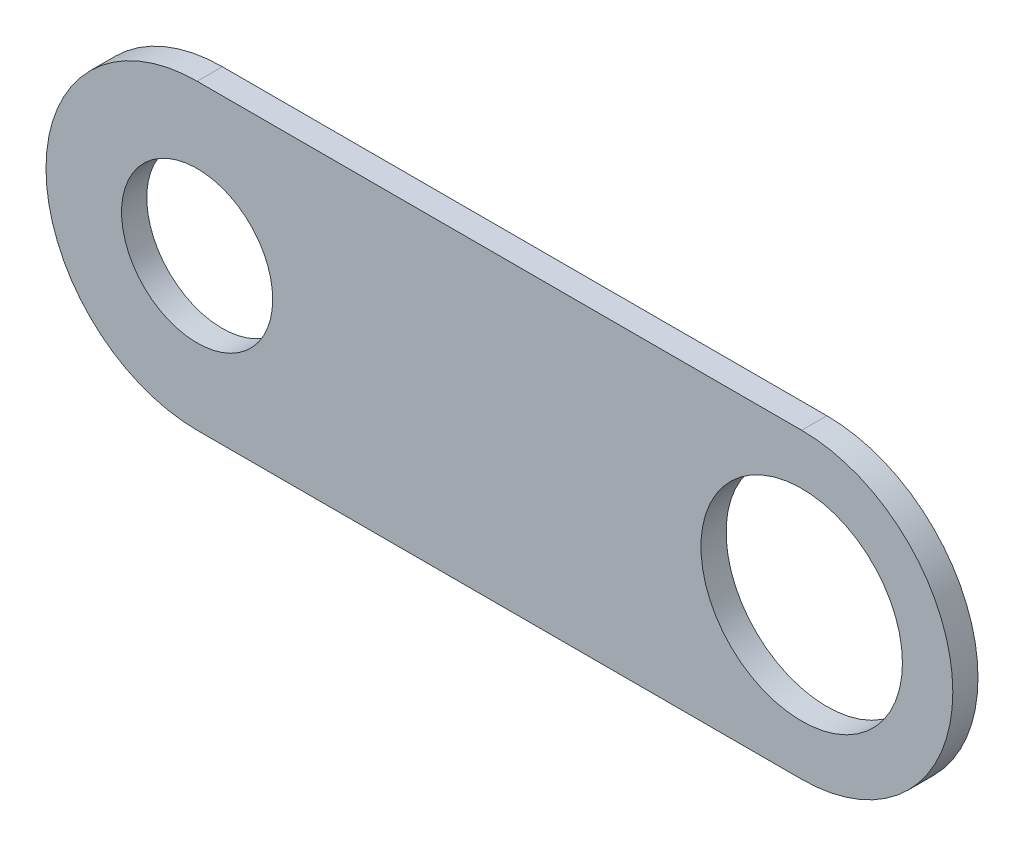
ISO-10303-21;
HEADER;
FILE_DESCRIPTION(('STEP AP214'),'2;1');
FILE_NAME('part.step','',(''),(''),'','','');
FILE_SCHEMA(('AUTOMOTIVE_DESIGN { 1 0 10303 214 1 1 1 1 }'));
ENDSEC;
DATA;
#1=APPLICATION_CONTEXT('core data for automotive mechanical design processes');
#2=APPLICATION_PROTOCOL_DEFINITION('international standard','automotive_design',2000,#1);
#3=PRODUCT_CONTEXT('',#1,'mechanical');
#4=PRODUCT('Part','Part','',(#3));
#5=PRODUCT_RELATED_PRODUCT_CATEGORY('part','',(#4));
#6=PRODUCT_DEFINITION_FORMATION('','',#4);
#7=PRODUCT_DEFINITION_CONTEXT('part definition',#1,'design');
#8=PRODUCT_DEFINITION('design','',#6,#7);
#9=PRODUCT_DEFINITION_SHAPE('','',#8);
#10=(LENGTH_UNIT() NAMED_UNIT(*) SI_UNIT(.MILLI.,.METRE.));
#11=(NAMED_UNIT(*) PLANE_ANGLE_UNIT() SI_UNIT($,.RADIAN.));
#12=(NAMED_UNIT(*) SI_UNIT($,.STERADIAN.) SOLID_ANGLE_UNIT());
#13=UNCERTAINTY_MEASURE_WITH_UNIT(LENGTH_MEASURE(1.E-05),#10,'distance_accuracy_value','');
#14=(GEOMETRIC_REPRESENTATION_CONTEXT(3) GLOBAL_UNCERTAINTY_ASSIGNED_CONTEXT((#13)) GLOBAL_UNIT_ASSIGNED_CONTEXT((#10,
#11,#12)) REPRESENTATION_CONTEXT('',''));
#15=CARTESIAN_POINT('',(0.,0.,0.));
#16=DIRECTION('',(0.,0.,1.));
#17=DIRECTION('',(1.,0.,0.));
#18=AXIS2_PLACEMENT_3D('',#15,#16,#17);
#19=CARTESIAN_POINT('',(0.,-19.05,1.5875));
#20=DIRECTION('',(0.,0.,1.));
#21=DIRECTION('',(1.,0.,0.));
#22=AXIS2_PLACEMENT_3D('',#19,#20,#21);
#23=PLANE('',#22);
#24=CARTESIAN_POINT('',(76.2,-19.05,1.5875));
#25=DIRECTION('',(0.,0.,1.));
#26=DIRECTION('',(1.,0.,0.));
#27=AXIS2_PLACEMENT_3D('',#24,#25,#26);
#28=CIRCLE('',#27,12.7);
#29=CARTESIAN_POINT('',(88.9,-19.05,1.5875));
#30=VERTEX_POINT('',#29);
#31=EDGE_CURVE('E118',#30,#30,#28,.T.);
#32=ORIENTED_EDGE('',*,*,#31,.F.);
#33=EDGE_LOOP('',(#32));
#34=FACE_BOUND('',#33,.T.);
#35=CARTESIAN_POINT('',(0.,-19.05,1.5875));
#36=DIRECTION('',(0.,0.,1.));
#37=DIRECTION('',(1.,0.,0.));
#38=AXIS2_PLACEMENT_3D('',#35,#36,#37);
#39=CIRCLE('',#38,19.05);
#40=CARTESIAN_POINT('',(0.,0.,1.5875));
#41=VERTEX_POINT('',#40);
#42=CARTESIAN_POINT('',(0.,-38.1,1.5875));
#43=VERTEX_POINT('',#42);
#44=EDGE_CURVE('E98',#41,#43,#39,.T.);
#45=ORIENTED_EDGE('',*,*,#44,.T.);
#46=DIRECTION('',(1.,0.,0.));
#47=VECTOR('',#46,1.);
#48=CARTESIAN_POINT('',(0.,-38.1,1.5875));
#49=LINE('',#48,#47);
#50=CARTESIAN_POINT('',(76.2,-38.1,1.5875));
#51=VERTEX_POINT('',#50);
#52=EDGE_CURVE('E93',#43,#51,#49,.T.);
#53=ORIENTED_EDGE('',*,*,#52,.T.);
#54=CARTESIAN_POINT('',(76.2,-19.05,1.5875));
#55=DIRECTION('',(0.,0.,1.));
#56=DIRECTION('',(1.,0.,0.));
#57=AXIS2_PLACEMENT_3D('',#54,#55,#56);
#58=CIRCLE('',#57,19.05);
#59=CARTESIAN_POINT('',(76.2,0.,1.5875));
#60=VERTEX_POINT('',#59);
#61=EDGE_CURVE('E96',#51,#60,#58,.T.);
#62=ORIENTED_EDGE('',*,*,#61,.T.);
#63=DIRECTION('',(-1.,0.,0.));
#64=VECTOR('',#63,1.);
#65=CARTESIAN_POINT('',(0.,0.,1.5875));
#66=LINE('',#65,#64);
#67=EDGE_CURVE('E63',#60,#41,#66,.T.);
#68=ORIENTED_EDGE('',*,*,#67,.T.);
#69=EDGE_LOOP('',(#45,#53,#62,#68));
#70=FACE_BOUND('',#69,.T.);
#71=CARTESIAN_POINT('',(0.,-19.05,1.5875));
#72=DIRECTION('',(0.,0.,1.));
#73=DIRECTION('',(1.,0.,0.));
#74=AXIS2_PLACEMENT_3D('',#71,#72,#73);
#75=CIRCLE('',#74,9.525);
#76=CARTESIAN_POINT('',(9.525,-19.05,1.5875));
#77=VERTEX_POINT('',#76);
#78=EDGE_CURVE('E140',#77,#77,#75,.T.);
#79=ORIENTED_EDGE('',*,*,#78,.F.);
#80=EDGE_LOOP('',(#79));
#81=FACE_BOUND('',#80,.T.);
#82=ADVANCED_FACE('F45',(#34,#70,#81),#23,.T.);
#83=CARTESIAN_POINT('',(0.,-19.05,-1.5875));
#84=DIRECTION('',(0.,0.,1.));
#85=DIRECTION('',(1.,0.,0.));
#86=AXIS2_PLACEMENT_3D('',#83,#84,#85);
#87=PLANE('',#86);
#88=CARTESIAN_POINT('',(0.,-19.05,-1.5875));
#89=DIRECTION('',(0.,0.,1.));
#90=DIRECTION('',(1.,0.,0.));
#91=AXIS2_PLACEMENT_3D('',#88,#89,#90);
#92=CIRCLE('',#91,19.05);
#93=CARTESIAN_POINT('',(0.,0.,-1.5875));
#94=VERTEX_POINT('',#93);
#95=CARTESIAN_POINT('',(0.,-38.1,-1.5875));
#96=VERTEX_POINT('',#95);
#97=EDGE_CURVE('E114',#94,#96,#92,.T.);
#98=ORIENTED_EDGE('',*,*,#97,.F.);
#99=DIRECTION('',(-1.,0.,0.));
#100=VECTOR('',#99,1.);
#101=CARTESIAN_POINT('',(0.,0.,-1.5875));
#102=LINE('',#101,#100);
#103=CARTESIAN_POINT('',(76.2,0.,-1.5875));
#104=VERTEX_POINT('',#103);
#105=EDGE_CURVE('E86',#104,#94,#102,.T.);
#106=ORIENTED_EDGE('',*,*,#105,.F.);
#107=CARTESIAN_POINT('',(76.2,-19.05,-1.5875));
#108=DIRECTION('',(0.,0.,1.));
#109=DIRECTION('',(1.,0.,0.));
#110=AXIS2_PLACEMENT_3D('',#107,#108,#109);
#111=CIRCLE('',#110,19.05);
#112=CARTESIAN_POINT('',(76.2,-38.1,-1.5875));
#113=VERTEX_POINT('',#112);
#114=EDGE_CURVE('E80',#113,#104,#111,.T.);
#115=ORIENTED_EDGE('',*,*,#114,.F.);
#116=DIRECTION('',(1.,0.,0.));
#117=VECTOR('',#116,1.);
#118=CARTESIAN_POINT('',(0.,-38.1,-1.5875));
#119=LINE('',#118,#117);
#120=EDGE_CURVE('E103',#96,#113,#119,.T.);
#121=ORIENTED_EDGE('',*,*,#120,.F.);
#122=EDGE_LOOP('',(#98,#106,#115,#121));
#123=FACE_BOUND('',#122,.T.);
#124=CARTESIAN_POINT('',(76.2,-19.05,-1.5875));
#125=DIRECTION('',(0.,0.,1.));
#126=DIRECTION('',(1.,0.,0.));
#127=AXIS2_PLACEMENT_3D('',#124,#125,#126);
#128=CIRCLE('',#127,12.7);
#129=CARTESIAN_POINT('',(88.9,-19.05,-1.5875));
#130=VERTEX_POINT('',#129);
#131=EDGE_CURVE('E136',#130,#130,#128,.T.);
#132=ORIENTED_EDGE('',*,*,#131,.T.);
#133=EDGE_LOOP('',(#132));
#134=FACE_BOUND('',#133,.T.);
#135=CARTESIAN_POINT('',(0.,-19.05,-1.5875));
#136=DIRECTION('',(0.,0.,1.));
#137=DIRECTION('',(1.,0.,0.));
#138=AXIS2_PLACEMENT_3D('',#135,#136,#137);
#139=CIRCLE('',#138,9.525);
#140=CARTESIAN_POINT('',(9.525,-19.05,-1.5875));
#141=VERTEX_POINT('',#140);
#142=EDGE_CURVE('E144',#141,#141,#139,.T.);
#143=ORIENTED_EDGE('',*,*,#142,.T.);
#144=EDGE_LOOP('',(#143));
#145=FACE_BOUND('',#144,.T.);
#146=ADVANCED_FACE('F131',(#123,#134,#145),#87,.F.);
#147=CARTESIAN_POINT('',(0.,-19.05,1.5875));
#148=DIRECTION('',(0.,0.,-1.));
#149=DIRECTION('',(-1.,0.,0.));
#150=AXIS2_PLACEMENT_3D('',#147,#148,#149);
#151=CYLINDRICAL_SURFACE('',#150,19.05);
#152=ORIENTED_EDGE('',*,*,#97,.T.);
#153=DIRECTION('',(0.,0.,-1.));
#154=VECTOR('',#153,1.);
#155=CARTESIAN_POINT('',(0.,-38.1,1.5875));
#156=LINE('',#155,#154);
#157=EDGE_CURVE('E11',#43,#96,#156,.T.);
#158=ORIENTED_EDGE('',*,*,#157,.F.);
#159=ORIENTED_EDGE('',*,*,#44,.F.);
#160=DIRECTION('',(0.,0.,-1.));
#161=VECTOR('',#160,1.);
#162=CARTESIAN_POINT('',(0.,0.,1.5875));
#163=LINE('',#162,#161);
#164=EDGE_CURVE('E110',#41,#94,#163,.T.);
#165=ORIENTED_EDGE('',*,*,#164,.T.);
#166=EDGE_LOOP('',(#152,#158,#159,#165));
#167=FACE_BOUND('',#166,.T.);
#168=ADVANCED_FACE('F47',(#167),#151,.T.);
#169=CARTESIAN_POINT('',(0.,-38.1,1.5875));
#170=DIRECTION('',(0.,1.,0.));
#171=DIRECTION('',(0.,0.,1.));
#172=AXIS2_PLACEMENT_3D('',#169,#170,#171);
#173=PLANE('',#172);
#174=ORIENTED_EDGE('',*,*,#120,.T.);
#175=DIRECTION('',(0.,0.,-1.));
#176=VECTOR('',#175,1.);
#177=CARTESIAN_POINT('',(76.2,-38.1,1.5875));
#178=LINE('',#177,#176);
#179=EDGE_CURVE('E55',#51,#113,#178,.T.);
#180=ORIENTED_EDGE('',*,*,#179,.F.);
#181=ORIENTED_EDGE('',*,*,#52,.F.);
#182=ORIENTED_EDGE('',*,*,#157,.T.);
#183=EDGE_LOOP('',(#174,#180,#181,#182));
#184=FACE_BOUND('',#183,.T.);
#185=ADVANCED_FACE('F102',(#184),#173,.F.);
#186=CARTESIAN_POINT('',(76.2,-19.05,1.5875));
#187=DIRECTION('',(0.,0.,-1.));
#188=DIRECTION('',(-1.,0.,0.));
#189=AXIS2_PLACEMENT_3D('',#186,#187,#188);
#190=CYLINDRICAL_SURFACE('',#189,19.05);
#191=ORIENTED_EDGE('',*,*,#114,.T.);
#192=DIRECTION('',(0.,0.,-1.));
#193=VECTOR('',#192,1.);
#194=CARTESIAN_POINT('',(76.2,0.,1.5875));
#195=LINE('',#194,#193);
#196=EDGE_CURVE('E105',#60,#104,#195,.T.);
#197=ORIENTED_EDGE('',*,*,#196,.F.);
#198=ORIENTED_EDGE('',*,*,#61,.F.);
#199=ORIENTED_EDGE('',*,*,#179,.T.);
#200=EDGE_LOOP('',(#191,#197,#198,#199));
#201=FACE_BOUND('',#200,.T.);
#202=ADVANCED_FACE('F106',(#201),#190,.T.);
#203=CARTESIAN_POINT('',(0.,0.,1.5875));
#204=DIRECTION('',(0.,-1.,0.));
#205=DIRECTION('',(0.,0.,-1.));
#206=AXIS2_PLACEMENT_3D('',#203,#204,#205);
#207=PLANE('',#206);
#208=ORIENTED_EDGE('',*,*,#105,.T.);
#209=ORIENTED_EDGE('',*,*,#164,.F.);
#210=ORIENTED_EDGE('',*,*,#67,.F.);
#211=ORIENTED_EDGE('',*,*,#196,.T.);
#212=EDGE_LOOP('',(#208,#209,#210,#211));
#213=FACE_BOUND('',#212,.T.);
#214=ADVANCED_FACE('F128',(#213),#207,.F.);
#215=CARTESIAN_POINT('',(76.2,-19.05,1.5875));
#216=DIRECTION('',(0.,0.,-1.));
#217=DIRECTION('',(-1.,0.,0.));
#218=AXIS2_PLACEMENT_3D('',#215,#216,#217);
#219=CYLINDRICAL_SURFACE('',#218,12.7);
#220=ORIENTED_EDGE('',*,*,#31,.T.);
#221=EDGE_LOOP('',(#220));
#222=FACE_BOUND('',#221,.T.);
#223=ORIENTED_EDGE('',*,*,#131,.F.);
#224=EDGE_LOOP('',(#223));
#225=FACE_BOUND('',#224,.T.);
#226=ADVANCED_FACE('F163',(#222,#225),#219,.F.);
#227=CARTESIAN_POINT('',(0.,-19.05,1.5875));
#228=DIRECTION('',(0.,0.,-1.));
#229=DIRECTION('',(-1.,0.,0.));
#230=AXIS2_PLACEMENT_3D('',#227,#228,#229);
#231=CYLINDRICAL_SURFACE('',#230,9.525);
#232=ORIENTED_EDGE('',*,*,#78,.T.);
#233=EDGE_LOOP('',(#232));
#234=FACE_BOUND('',#233,.T.);
#235=ORIENTED_EDGE('',*,*,#142,.F.);
#236=EDGE_LOOP('',(#235));
#237=FACE_BOUND('',#236,.T.);
#238=ADVANCED_FACE('F152',(#234,#237),#231,.F.);
#239=CLOSED_SHELL('',(#82,#146,#168,#185,#202,#214,#226,#238));
#240=MANIFOLD_SOLID_BREP('B2',#239);
#241=ADVANCED_BREP_SHAPE_REPRESENTATION('',(#18,#240),#14);
#242=SHAPE_DEFINITION_REPRESENTATION(#9,#241);
ENDSEC;
END-ISO-10303-21;
